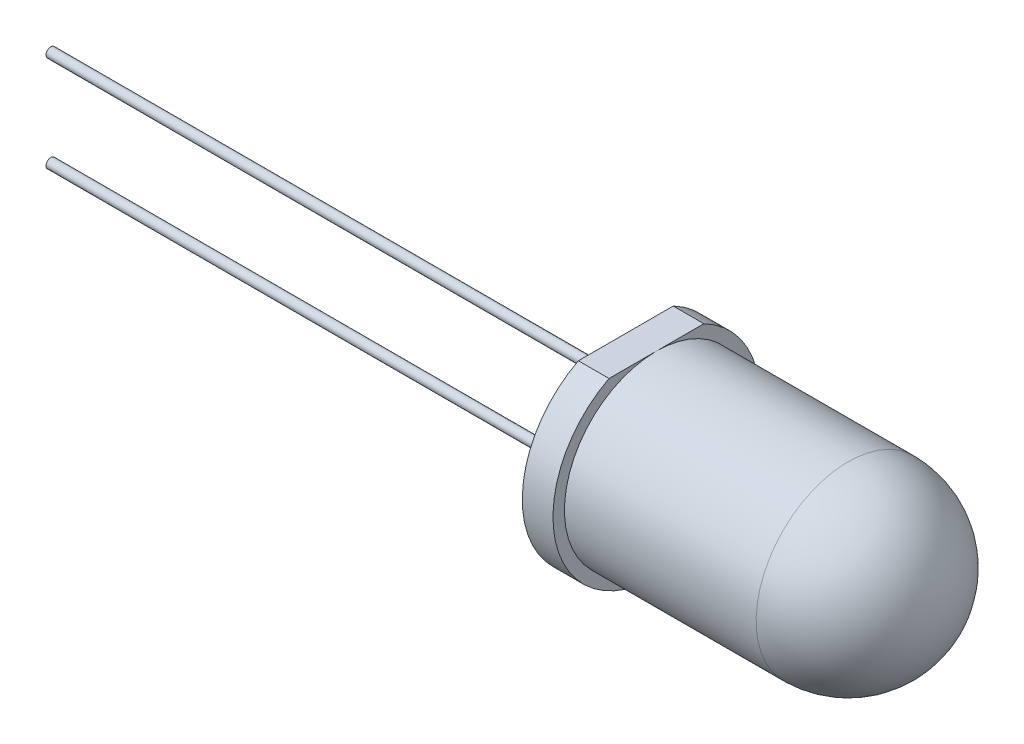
from build123d import *

# Parameters (mm, degrees)
ESQUISSE2_R             = 0.125
BOSS_EXTRU_1_DEPTH      = 15
ESQUISSE4_W             = 4.264018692
ESQUISSE4_H             = 0.605215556
ENL_V_MAT_EXTRU_1_DEPTH = 17.254845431


with BuildPart() as part:
    # Esquisse1 → R_volution1 (revolve)
    with BuildSketch(Plane.XY, mode=Mode.PRIVATE) as r_volution1_sk:
        with BuildLine():
            Line((0, 2.4), (0, 2.7))
            Line((0, 2.7), (-0.8, 2.7))
            Line((-0.8, 2.7), (-0.8, 0))
            Line((-0.8, 0), (7.4, 0))
            ThreePointArc((7.4, 0), (6.697056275, 1.697056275), (5, 2.4))
            Line((5, 2.4), (0, 2.4))
        make_face()
    revolve(r_volution1_sk.sketch.rotate(Axis((-0.8, 0, 0), (-1, 0, 0)), 90), axis=Axis((-0.8, 0, 0), (-1, 0, 0)))

    # Esquisse2 → Boss.-Extru.1 (add)
    with BuildSketch(Plane.ZY.offset(0.8)):
        with Locations((0, 1.25)):
            Circle(ESQUISSE2_R)
        with Locations((0, -1.25)):
            Circle(ESQUISSE2_R)
    extrude(amount=BOSS_EXTRU_1_DEPTH)

    # Esquisse4 → Enl_v. mat.-Extru.1 (cut, through all)
    with BuildSketch(Plane(origin=(0, 0, 0), x_dir=(0, 0, -1), z_dir=(1, 0, 0))):
        with Locations((0.037825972, 2.702607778)):
            Rectangle(ESQUISSE4_W, ESQUISSE4_H)
    extrude(amount=-ENL_V_MAT_EXTRU_1_DEPTH, mode=Mode.SUBTRACT)


solid = part.part
